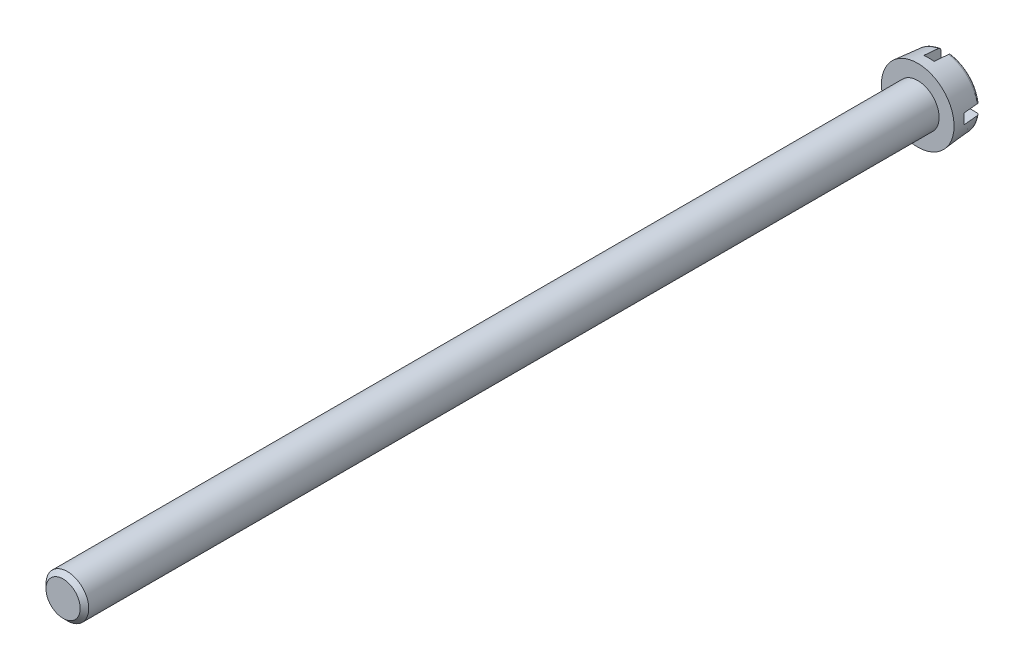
from build123d import *

# Parameters (mm, degrees)
ESQUISSE2_W                  = 8.5
ESQUISSE2_H                  = 1.2
ENLEV_MAT_EXTRU_1_DEPTH      = 2
R_P_TITION_CIRCULAIRE1_COUNT = 2
R_P_TITION_CIRCULAIRE1_ANGLE = 270
ESQUISSE3_W                  = 2.5
ESQUISSE3_H                  = 100
CHANFREIN1_SIZE              = 0.5


with BuildPart() as part:
    # Esquisse1 → Base-R_volution (revolve)
    with BuildSketch(Plane(origin=(0, 0, 0), x_dir=(1, 0, 0), z_dir=(0, 1, 0)), mode=Mode.PRIVATE) as base_r_volution_sk:
        with BuildLine():
            Line((0, 0), (4.25, 0))
            Line((4.25, 0), (3.987642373, 2.998761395))
            ThreePointArc((3.987642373, 2.998761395), (3.881842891, 3.213301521), (3.658898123, 3.3))
            Line((3.658898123, 3.3), (0, 3.3))
            Line((0, 3.3), (0, 0))
        make_face()
    revolve(base_r_volution_sk.sketch.rotate(Axis((0, 0, 0), (0, 0, -1)), 180), axis=Axis((0, 0, 0), (0, 0, -1)))

    # Esquisse2 → Enlev. mat.-Extru.1 (cut)
    with BuildSketch(Plane.XY.offset(-3.3)):
        Rectangle(ESQUISSE2_W, ESQUISSE2_H)
    enlev_mat_extru_1 = extrude(amount=ENLEV_MAT_EXTRU_1_DEPTH, mode=Mode.SUBTRACT)

    # R_p_tition circulaire1: Enlev. mat.-Extru.1 ×2 about axis
    r_p_tition_circulaire1_axis = Axis((0, 0, 0), (0, 0, -1))
    for i in range(1, R_P_TITION_CIRCULAIRE1_COUNT):
        add(enlev_mat_extru_1.rotate(r_p_tition_circulaire1_axis, i * R_P_TITION_CIRCULAIRE1_ANGLE / (R_P_TITION_CIRCULAIRE1_COUNT - 1)), mode=Mode.SUBTRACT)

    # Esquisse3 → Boss.-R_vol.1 (revolve)
    with BuildSketch(Plane(origin=(0, 0, 0), x_dir=(1, 0, 0), z_dir=(0, 1, 0)), mode=Mode.PRIVATE) as boss_r_vol_1_sk:
        with Locations((1.25, -50)):
            Rectangle(ESQUISSE3_W, ESQUISSE3_H)
    revolve(boss_r_vol_1_sk.sketch.rotate(Axis((0, 0, 0), (0, 0, 1)), 351.659338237), axis=Axis((0, 0, 0), (0, 0, 1)))

    # Chanfrein1
    chanfrein1_edges = [part.edges().sort_by_distance(p)[0] for p in [
        (-2.473557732, 0.362646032, 100),
    ]]
    chamfer(chanfrein1_edges, length=CHANFREIN1_SIZE)


solid = part.part
